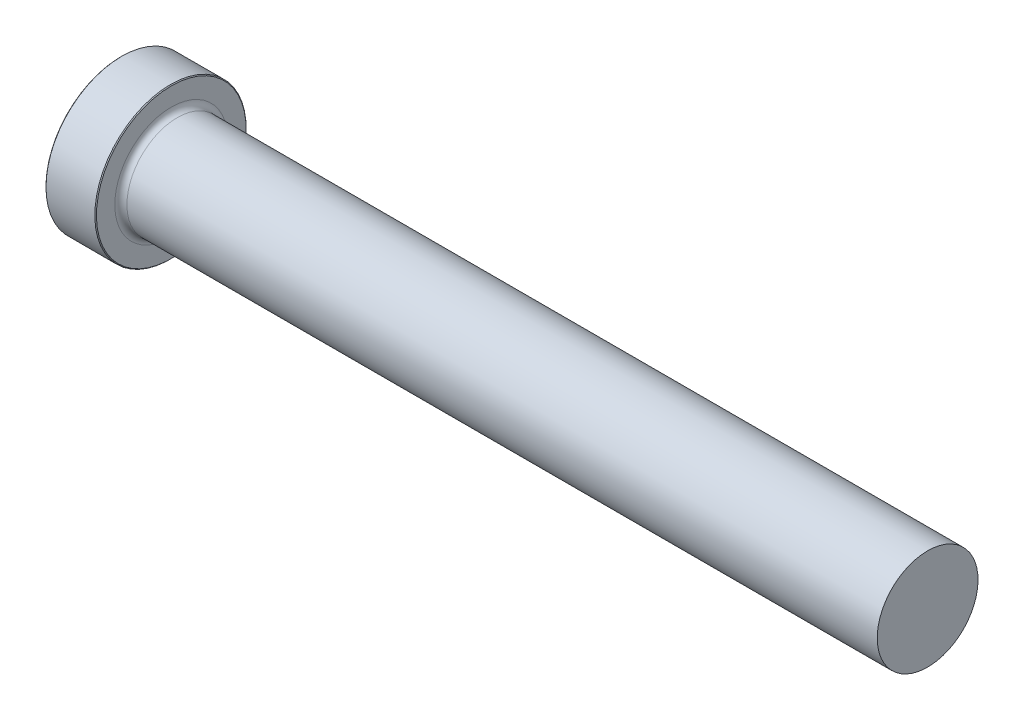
from build123d import *

# Parameters (mm, degrees)
CHAMFER1_SIZE = 0.1016


with BuildPart() as part:
    # Sketch1 → Revolve1 (revolve)
    with BuildSketch(Plane.XY):
        with BuildLine():
            Line((0, 0), (0, 9.525))
            Line((0, 9.525), (6.35, 9.525))
            Line((6.35, 9.525), (6.35, 7.10819))
            ThreePointArc((6.35, 7.10819), (6.573184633, 6.569374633), (7.112, 6.34619))
            Line((7.112, 6.34619), (101.6, 6.34619))
            Line((101.6, 6.34619), (101.6, 0))
            Line((101.6, 0), (0, 0))
        make_face()
    revolve(axis=Axis((101.6, 0, 0), (-1, 0, 0)))

    # Chamfer1
    chamfer1_edges = [part.edges().sort_by_distance(p)[0] for p in [
        (0, -9.525, 0),
        (6.35, -9.525, 0),
    ]]
    chamfer(chamfer1_edges, length=CHAMFER1_SIZE)


solid = part.part
